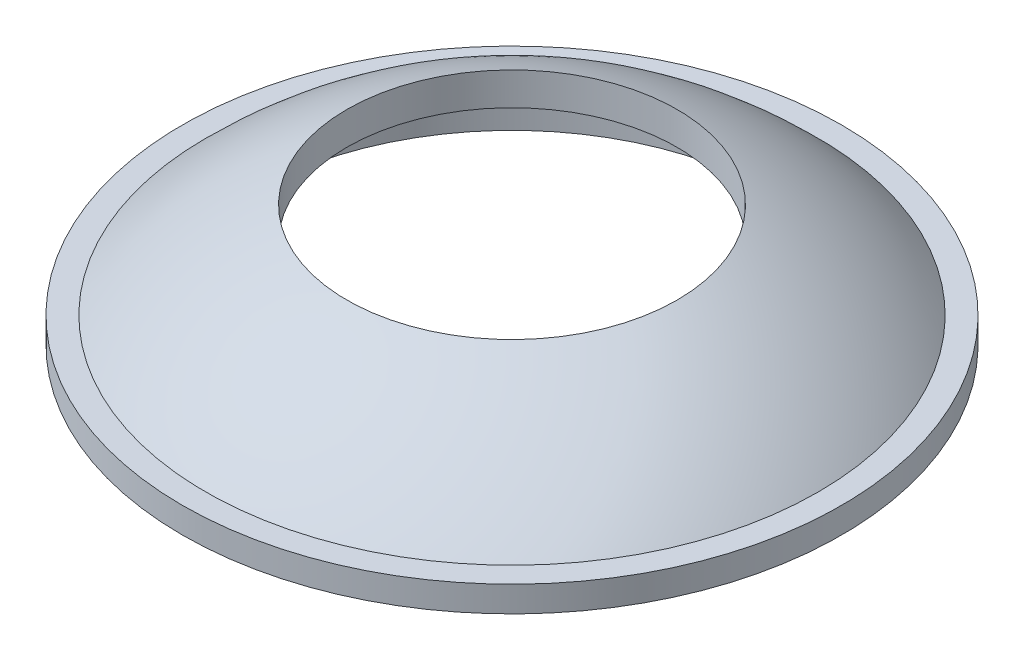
ISO-10303-21;
HEADER;
FILE_DESCRIPTION(('STEP AP214'),'2;1');
FILE_NAME('part.step','',(''),(''),'','','');
FILE_SCHEMA(('AUTOMOTIVE_DESIGN { 1 0 10303 214 1 1 1 1 }'));
ENDSEC;
DATA;
#1=APPLICATION_CONTEXT('core data for automotive mechanical design processes');
#2=APPLICATION_PROTOCOL_DEFINITION('international standard','automotive_design',2000,#1);
#3=PRODUCT_CONTEXT('',#1,'mechanical');
#4=PRODUCT('Part','Part','',(#3));
#5=PRODUCT_RELATED_PRODUCT_CATEGORY('part','',(#4));
#6=PRODUCT_DEFINITION_FORMATION('','',#4);
#7=PRODUCT_DEFINITION_CONTEXT('part definition',#1,'design');
#8=PRODUCT_DEFINITION('design','',#6,#7);
#9=PRODUCT_DEFINITION_SHAPE('','',#8);
#10=(LENGTH_UNIT() NAMED_UNIT(*) SI_UNIT(.MILLI.,.METRE.));
#11=(NAMED_UNIT(*) PLANE_ANGLE_UNIT() SI_UNIT($,.RADIAN.));
#12=(NAMED_UNIT(*) SI_UNIT($,.STERADIAN.) SOLID_ANGLE_UNIT());
#13=UNCERTAINTY_MEASURE_WITH_UNIT(LENGTH_MEASURE(1.E-05),#10,'distance_accuracy_value','');
#14=(GEOMETRIC_REPRESENTATION_CONTEXT(3) GLOBAL_UNCERTAINTY_ASSIGNED_CONTEXT((#13)) GLOBAL_UNIT_ASSIGNED_CONTEXT((#10,
#11,#12)) REPRESENTATION_CONTEXT('',''));
#15=CARTESIAN_POINT('',(0.,0.,0.));
#16=DIRECTION('',(0.,0.,1.));
#17=DIRECTION('',(1.,0.,0.));
#18=AXIS2_PLACEMENT_3D('',#15,#16,#17);
#19=CARTESIAN_POINT('',(0.,7.,0.));
#20=DIRECTION('',(0.,-1.,0.));
#21=DIRECTION('',(0.,0.,-1.));
#22=AXIS2_PLACEMENT_3D('',#19,#20,#21);
#23=CYLINDRICAL_SURFACE('',#22,6.125);
#24=CARTESIAN_POINT('',(0.,6.99816940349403,0.));
#25=DIRECTION('',(0.,-1.,0.));
#26=DIRECTION('',(0.,0.,-1.));
#27=AXIS2_PLACEMENT_3D('',#24,#25,#26);
#28=CIRCLE('',#27,6.125);
#29=CARTESIAN_POINT('',(6.125,6.99816940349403,0.));
#30=VERTEX_POINT('',#29);
#31=EDGE_CURVE('E43',#30,#30,#28,.T.);
#32=ORIENTED_EDGE('',*,*,#31,.F.);
#33=EDGE_LOOP('',(#32));
#34=FACE_BOUND('',#33,.T.);
#35=CARTESIAN_POINT('',(0.,6.4,0.));
#36=DIRECTION('',(0.,-1.,0.));
#37=DIRECTION('',(0.,0.,-1.));
#38=AXIS2_PLACEMENT_3D('',#35,#36,#37);
#39=CIRCLE('',#38,6.125);
#40=CARTESIAN_POINT('',(0.,6.4,-6.125));
#41=VERTEX_POINT('',#40);
#42=EDGE_CURVE('E57',#41,#41,#39,.T.);
#43=ORIENTED_EDGE('',*,*,#42,.T.);
#44=EDGE_LOOP('',(#43));
#45=FACE_BOUND('',#44,.T.);
#46=ADVANCED_FACE('F35',(#34,#45),#23,.F.);
#47=CARTESIAN_POINT('',(13.,6.4,-14.2353691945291));
#48=DIRECTION('',(0.,-1.,0.));
#49=DIRECTION('',(0.,0.,-1.));
#50=AXIS2_PLACEMENT_3D('',#47,#48,#49);
#51=PLANE('',#50);
#52=CARTESIAN_POINT('',(0.,6.4,0.));
#53=DIRECTION('',(0.,-1.,0.));
#54=DIRECTION('',(0.,0.,-1.));
#55=AXIS2_PLACEMENT_3D('',#52,#53,#54);
#56=CIRCLE('',#55,7.68374908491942);
#57=CARTESIAN_POINT('',(0.,6.4,-7.68374908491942));
#58=VERTEX_POINT('',#57);
#59=EDGE_CURVE('E10',#58,#58,#56,.F.);
#60=ORIENTED_EDGE('',*,*,#59,.F.);
#61=EDGE_LOOP('',(#60));
#62=FACE_BOUND('',#61,.T.);
#63=ORIENTED_EDGE('',*,*,#42,.F.);
#64=EDGE_LOOP('',(#63));
#65=FACE_BOUND('',#64,.T.);
#66=ADVANCED_FACE('F86',(#62,#65),#51,.T.);
#67=CARTESIAN_POINT('',(0.,0.,0.));
#68=DIRECTION('',(0.,-1.,0.));
#69=DIRECTION('',(1.,0.,0.));
#70=AXIS2_PLACEMENT_3D('',#67,#68,#69);
#71=SPHERICAL_SURFACE('',#70,9.3);
#72=CARTESIAN_POINT('',(0.,8.46566595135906,0.));
#73=DIRECTION('',(0.,-1.,0.));
#74=DIRECTION('',(0.,0.,-1.));
#75=AXIS2_PLACEMENT_3D('',#72,#73,#74);
#76=CIRCLE('',#75,3.85);
#77=CARTESIAN_POINT('',(3.85,8.46566595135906,0.));
#78=VERTEX_POINT('',#77);
#79=EDGE_CURVE('E61',#78,#78,#76,.T.);
#80=CARTESIAN_POINT('',(3.85,8.46566595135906,0.));
#81=CARTESIAN_POINT('',(3.87576201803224,8.45394995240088,0.));
#82=CARTESIAN_POINT('',(3.90147055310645,8.44211635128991,0.));
#83=CARTESIAN_POINT('',(3.95277852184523,8.4182149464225,0.));
#84=CARTESIAN_POINT('',(3.9783779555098,8.40614714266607,0.));
#85=CARTESIAN_POINT('',(4.02946558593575,8.38177833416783,0.));
#86=CARTESIAN_POINT('',(4.05495378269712,8.36947732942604,0.));
#87=CARTESIAN_POINT('',(4.10581681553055,8.34464314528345,0.));
#88=CARTESIAN_POINT('',(4.13119165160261,8.33210996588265,0.));
#89=CARTESIAN_POINT('',(4.18182584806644,8.30681247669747,0.));
#90=CARTESIAN_POINT('',(4.2070852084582,8.29404816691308,0.));
#91=CARTESIAN_POINT('',(4.25748634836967,8.26828948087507,0.));
#92=CARTESIAN_POINT('',(4.28262812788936,8.25529510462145,0.));
#93=CARTESIAN_POINT('',(4.33279201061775,8.22907736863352,0.));
#94=CARTESIAN_POINT('',(4.35781411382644,8.21585400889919,0.));
#95=CARTESIAN_POINT('',(4.4077365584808,8.18917940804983,0.));
#96=CARTESIAN_POINT('',(4.43263689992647,8.1757281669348,0.));
#97=CARTESIAN_POINT('',(4.48231374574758,8.14859892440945,0.));
#98=CARTESIAN_POINT('',(4.50709025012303,8.13492092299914,0.));
#99=CARTESIAN_POINT('',(4.55651735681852,8.10733929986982,0.));
#100=CARTESIAN_POINT('',(4.58116795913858,8.09343567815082,0.));
#101=CARTESIAN_POINT('',(4.63034120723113,8.06540397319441,0.));
#102=CARTESIAN_POINT('',(4.65486385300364,8.051275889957,0.));
#103=CARTESIAN_POINT('',(4.70377914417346,8.02279643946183,0.));
#104=CARTESIAN_POINT('',(4.72817178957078,8.00844507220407,0.));
#105=CARTESIAN_POINT('',(4.77682504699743,7.97952024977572,0.));
#106=CARTESIAN_POINT('',(4.80108565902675,7.96494679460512,0.));
#107=CARTESIAN_POINT('',(4.84947282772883,7.93557901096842,0.));
#108=CARTESIAN_POINT('',(4.87359938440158,7.92078468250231,0.));
#109=CARTESIAN_POINT('',(4.92171643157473,7.89097638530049,0.));
#110=CARTESIAN_POINT('',(4.94570692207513,7.87596241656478,0.));
#111=CARTESIAN_POINT('',(4.99354983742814,7.84571609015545,0.));
#112=CARTESIAN_POINT('',(5.01740226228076,7.83048373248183,0.));
#113=CARTESIAN_POINT('',(5.0649670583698,7.79980189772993,0.));
#114=CARTESIAN_POINT('',(5.08867942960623,7.78435242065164,0.));
#115=CARTESIAN_POINT('',(5.13596214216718,7.75323763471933,0.));
#116=CARTESIAN_POINT('',(5.15953248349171,7.7375723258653,0.));
#117=CARTESIAN_POINT('',(5.20652917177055,7.70602718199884,0.));
#118=CARTESIAN_POINT('',(5.22995551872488,7.69014734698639,0.));
#119=CARTESIAN_POINT('',(5.27666226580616,7.6581744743,0.));
#120=CARTESIAN_POINT('',(5.29994266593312,7.64208143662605,0.));
#121=CARTESIAN_POINT('',(5.34635557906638,7.6096834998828,0.));
#122=CARTESIAN_POINT('',(5.36948809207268,7.5933786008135,0.));
#123=CARTESIAN_POINT('',(5.41560330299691,7.56055830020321,0.));
#124=CARTESIAN_POINT('',(5.43858600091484,7.54404289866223,0.));
#125=CARTESIAN_POINT('',(5.48439966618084,7.51080296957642,0.));
#126=CARTESIAN_POINT('',(5.50723063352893,7.4940784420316,0.));
#127=CARTESIAN_POINT('',(5.55273893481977,7.46042165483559,0.));
#128=CARTESIAN_POINT('',(5.57541626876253,7.4434893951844,0.));
#129=CARTESIAN_POINT('',(5.62061541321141,7.40941855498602,0.));
#130=CARTESIAN_POINT('',(5.64313722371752,7.39227997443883,0.));
#131=CARTESIAN_POINT('',(5.68802344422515,7.35779792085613,0.));
#132=CARTESIAN_POINT('',(5.71038785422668,7.34045444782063,0.));
#133=CARTESIAN_POINT('',(5.7549574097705,7.30556405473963,0.));
#134=CARTESIAN_POINT('',(5.77716255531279,7.28801713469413,0.));
#135=CARTESIAN_POINT('',(5.82141173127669,7.25272131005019,0.));
#136=CARTESIAN_POINT('',(5.84345576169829,7.23497240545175,0.));
#137=CARTESIAN_POINT('',(5.88738087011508,7.19927409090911,0.));
#138=CARTESIAN_POINT('',(5.90926194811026,7.1813246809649,0.));
#139=CARTESIAN_POINT('',(5.95285932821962,7.14522685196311,0.));
#140=CARTESIAN_POINT('',(5.97457563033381,7.12707843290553,0.));
#141=CARTESIAN_POINT('',(6.01784164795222,7.09058409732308,0.));
#142=CARTESIAN_POINT('',(6.03939136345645,7.0722381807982,0.));
#143=CARTESIAN_POINT('',(6.08232241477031,7.03535038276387,0.));
#144=CARTESIAN_POINT('',(6.10370375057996,7.01680850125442,0.));
#145=CARTESIAN_POINT('',(6.125,6.99816940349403,0.));
#146=B_SPLINE_CURVE_WITH_KNOTS('',3,(#80,#81,#82,#83,#84,#85,#86,#87,#88,#89,#90,#91,#92,#93,
#94,#95,#96,#97,#98,#99,#100,#101,#102,#103,#104,#105,#106,#107,#108,#109,#110,#111,#112,#113,
#114,#115,#116,#117,#118,#119,#120,#121,#122,#123,#124,#125,#126,#127,#128,#129,#130,#131,#132,
#133,#134,#135,#136,#137,#138,#139,#140,#141,#142,#143,#144,#145),.UNSPECIFIED.,.F.,.F.,(4,2,2,
2,2,2,2,2,2,2,2,2,2,2,2,2,2,2,2,2,2,2,2,2,2,2,2,2,2,2,2,2,4),(0.,0.0849026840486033,
0.169805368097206,0.254708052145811,0.339610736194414,0.424513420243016,0.50941610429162,
0.594318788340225,0.679221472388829,0.76412415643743,0.849026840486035,0.933929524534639,
1.01883220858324,1.10373489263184,1.18863757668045,1.27354026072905,1.35844294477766,
1.44334562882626,1.52824831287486,1.61315099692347,1.69805368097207,1.78295636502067,
1.86785904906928,1.95276173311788,2.03766441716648,2.12256710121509,2.20746978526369,
2.29237246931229,2.3772751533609,2.4621778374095,2.5470805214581,2.63198320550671,
2.71688588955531),.UNSPECIFIED.);
#147=EDGE_CURVE('BSEAM93',#78,#30,#146,.T.);
#148=ORIENTED_EDGE('',*,*,#79,.F.);
#149=ORIENTED_EDGE('',*,*,#31,.T.);
#150=ORIENTED_EDGE('',*,*,#147,.T.);
#151=ORIENTED_EDGE('',*,*,#147,.F.);
#152=EDGE_LOOP('',(#148,#150,#149,#151));
#153=FACE_BOUND('',#152,.T.);
#154=ADVANCED_FACE('F93',(#153),#71,.F.);
#155=CARTESIAN_POINT('',(0.,7.,0.));
#156=DIRECTION('',(0.,-1.,0.));
#157=DIRECTION('',(0.,0.,-1.));
#158=AXIS2_PLACEMENT_3D('',#155,#156,#157);
#159=CYLINDRICAL_SURFACE('',#158,7.68374908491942);
#160=CARTESIAN_POINT('',(0.,7.,0.));
#161=DIRECTION('',(0.,-1.,0.));
#162=DIRECTION('',(0.,0.,-1.));
#163=AXIS2_PLACEMENT_3D('',#160,#161,#162);
#164=CIRCLE('',#163,7.68374908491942);
#165=CARTESIAN_POINT('',(0.,7.,-7.68374908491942));
#166=VERTEX_POINT('',#165);
#167=EDGE_CURVE('E51',#166,#166,#164,.T.);
#168=ORIENTED_EDGE('',*,*,#167,.T.);
#169=EDGE_LOOP('',(#168));
#170=FACE_BOUND('',#169,.T.);
#171=ORIENTED_EDGE('',*,*,#59,.T.);
#172=EDGE_LOOP('',(#171));
#173=FACE_BOUND('',#172,.T.);
#174=ADVANCED_FACE('F82',(#170,#173),#159,.T.);
#175=CARTESIAN_POINT('',(0.,7.,0.));
#176=DIRECTION('',(0.,-1.,0.));
#177=DIRECTION('',(0.,0.,-1.));
#178=AXIS2_PLACEMENT_3D('',#175,#176,#177);
#179=PLANE('',#178);
#180=CARTESIAN_POINT('',(0.,7.,0.));
#181=DIRECTION('',(0.,-1.,0.));
#182=DIRECTION('',(0.,0.,-1.));
#183=AXIS2_PLACEMENT_3D('',#180,#181,#182);
#184=CIRCLE('',#183,7.14142842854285);
#185=CARTESIAN_POINT('',(7.14142842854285,7.,0.));
#186=VERTEX_POINT('',#185);
#187=EDGE_CURVE('E48',#186,#186,#184,.F.);
#188=ORIENTED_EDGE('',*,*,#187,.F.);
#189=EDGE_LOOP('',(#188));
#190=FACE_BOUND('',#189,.T.);
#191=ORIENTED_EDGE('',*,*,#167,.F.);
#192=EDGE_LOOP('',(#191));
#193=FACE_BOUND('',#192,.T.);
#194=ADVANCED_FACE('F74',(#190,#193),#179,.F.);
#195=CARTESIAN_POINT('',(0.,0.,0.));
#196=DIRECTION('',(0.,-1.,0.));
#197=DIRECTION('',(1.,0.,0.));
#198=AXIS2_PLACEMENT_3D('',#195,#196,#197);
#199=SPHERICAL_SURFACE('',#198,10.);
#200=CARTESIAN_POINT('',(0.,9.22916572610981,0.));
#201=DIRECTION('',(0.,-1.,0.));
#202=DIRECTION('',(0.,0.,-1.));
#203=AXIS2_PLACEMENT_3D('',#200,#201,#202);
#204=CIRCLE('',#203,3.85);
#205=CARTESIAN_POINT('',(3.85,9.22916572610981,0.));
#206=VERTEX_POINT('',#205);
#207=EDGE_CURVE('E39',#206,#206,#204,.F.);
#208=CARTESIAN_POINT('',(3.85,9.22916572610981,0.));
#209=CARTESIAN_POINT('',(3.88847322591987,9.21311641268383,0.));
#210=CARTESIAN_POINT('',(3.92684608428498,9.19682650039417,0.));
#211=CARTESIAN_POINT('',(4.00338508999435,9.16376808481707,0.));
#212=CARTESIAN_POINT('',(4.04155123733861,9.14699958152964,0.));
#213=CARTESIAN_POINT('',(4.11767084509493,9.11298659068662,0.));
#214=CARTESIAN_POINT('',(4.15562430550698,9.09574210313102,0.));
#215=CARTESIAN_POINT('',(4.23131260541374,9.06077984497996,0.));
#216=CARTESIAN_POINT('',(4.26904744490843,9.04306207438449,0.));
#217=CARTESIAN_POINT('',(4.34429260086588,9.00715602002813,0.));
#218=CARTESIAN_POINT('',(4.38180291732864,8.98896773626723,0.));
#219=CARTESIAN_POINT('',(4.45659316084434,8.95212350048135,0.));
#220=CARTESIAN_POINT('',(4.4938730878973,8.93346754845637,0.));
#221=CARTESIAN_POINT('',(4.56819672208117,8.89569089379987,0.));
#222=CARTESIAN_POINT('',(4.60524042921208,8.87657019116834,0.));
#223=CARTESIAN_POINT('',(4.67908583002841,8.83786702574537,0.));
#224=CARTESIAN_POINT('',(4.71588752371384,8.81828456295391,0.));
#225=CARTESIAN_POINT('',(4.789243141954,8.77866093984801,0.));
#226=CARTESIAN_POINT('',(4.82579706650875,8.75861977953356,0.));
#227=CARTESIAN_POINT('',(4.89865142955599,8.71808189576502,0.));
#228=CARTESIAN_POINT('',(4.93495186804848,8.69758517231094,0.));
#229=CARTESIAN_POINT('',(5.00729358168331,8.65613936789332,0.));
#230=CARTESIAN_POINT('',(5.04333485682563,8.63519028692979,0.));
#231=CARTESIAN_POINT('',(5.11515260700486,8.59284304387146,0.));
#232=CARTESIAN_POINT('',(5.15092908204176,8.57144488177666,0.));
#233=CARTESIAN_POINT('',(5.22221163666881,8.52820282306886,0.));
#234=CARTESIAN_POINT('',(5.25771771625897,8.50635892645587,0.));
#235=CARTESIAN_POINT('',(5.32845392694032,8.46222881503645,0.));
#236=CARTESIAN_POINT('',(5.36368405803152,8.43994260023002,0.));
#237=CARTESIAN_POINT('',(5.43386286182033,8.3949313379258,0.));
#238=CARTESIAN_POINT('',(5.46881153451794,8.37220629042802,0.));
#239=CARTESIAN_POINT('',(5.53842195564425,8.32632091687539,0.));
#240=CARTESIAN_POINT('',(5.57308370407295,8.30316059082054,0.));
#241=CARTESIAN_POINT('',(5.64211485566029,8.25640828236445,0.));
#242=CARTESIAN_POINT('',(5.67648425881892,8.23281629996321,0.));
#243=CARTESIAN_POINT('',(5.74492534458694,8.18520436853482,0.));
#244=CARTESIAN_POINT('',(5.77899702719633,8.16118441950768,0.));
#245=CARTESIAN_POINT('',(5.84683734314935,8.1127203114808,0.));
#246=CARTESIAN_POINT('',(5.88060597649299,8.08827615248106,0.));
#247=CARTESIAN_POINT('',(5.94783491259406,8.03896744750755,0.));
#248=CARTESIAN_POINT('',(5.9812952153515,8.01410290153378,0.));
#249=CARTESIAN_POINT('',(6.04790225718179,7.96395731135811,0.));
#250=CARTESIAN_POINT('',(6.08104899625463,7.93867626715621,0.));
#251=CARTESIAN_POINT('',(6.14702372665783,7.8877016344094,0.));
#252=CARTESIAN_POINT('',(6.17985171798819,7.86200804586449,0.));
#253=CARTESIAN_POINT('',(6.24518381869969,7.81021234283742,0.));
#254=CARTESIAN_POINT('',(6.27768792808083,7.78411022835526,0.));
#255=CARTESIAN_POINT('',(6.34236718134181,7.73150155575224,0.));
#256=CARTESIAN_POINT('',(6.37454232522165,7.70499499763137,0.));
#257=CARTESIAN_POINT('',(6.4385586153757,7.65158158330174,0.));
#258=CARTESIAN_POINT('',(6.47039976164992,7.62467472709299,0.));
#259=CARTESIAN_POINT('',(6.53374307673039,7.5704649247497,0.));
#260=CARTESIAN_POINT('',(6.56524524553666,7.54316197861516,0.));
#261=CARTESIAN_POINT('',(6.62790567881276,7.48816426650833,0.));
#262=CARTESIAN_POINT('',(6.6590639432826,7.46046950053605,0.));
#263=CARTESIAN_POINT('',(6.7210316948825,7.40469248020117,0.));
#264=CARTESIAN_POINT('',(6.75184118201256,7.37661022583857,0.));
#265=CARTESIAN_POINT('',(6.8131065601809,7.32006262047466,0.));
#266=CARTESIAN_POINT('',(6.84356245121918,7.29159726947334,0.));
#267=CARTESIAN_POINT('',(6.90411587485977,7.23428792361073,0.));
#268=CARTESIAN_POINT('',(6.93421340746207,7.20544392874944,0.));
#269=CARTESIAN_POINT('',(6.99404540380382,7.14738180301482,0.));
#270=CARTESIAN_POINT('',(7.02377986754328,7.11816367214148,0.));
#271=CARTESIAN_POINT('',(7.08288108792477,7.05935785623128,0.));
#272=CARTESIAN_POINT('',(7.11224784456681,7.0297701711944,0.));
#273=CARTESIAN_POINT('',(7.14142842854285,7.,0.));
#274=B_SPLINE_CURVE_WITH_KNOTS('',3,(#208,#209,#210,#211,#212,#213,#214,#215,#216,#217,#218,
#219,#220,#221,#222,#223,#224,#225,#226,#227,#228,#229,#230,#231,#232,#233,#234,#235,#236,#237,
#238,#239,#240,#241,#242,#243,#244,#245,#246,#247,#248,#249,#250,#251,#252,#253,#254,#255,#256,
#257,#258,#259,#260,#261,#262,#263,#264,#265,#266,#267,#268,#269,#270,#271,#272,#273),
.UNSPECIFIED.,.F.,.F.,(4,2,2,2,2,2,2,2,2,2,2,2,2,2,2,2,2,2,2,2,2,2,2,2,2,2,2,2,2,2,2,2,4),(0.,
0.125058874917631,0.250117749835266,0.375176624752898,0.50023549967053,0.625294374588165,
0.750353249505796,0.875412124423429,1.00047099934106,1.12552987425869,1.25058874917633,
1.37564762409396,1.50070649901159,1.62576537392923,1.75082424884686,1.87588312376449,
2.00094199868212,2.12600087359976,2.25105974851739,2.37611862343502,2.50117749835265,
2.62623637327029,2.75129524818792,2.87635412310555,3.00141299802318,3.12647187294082,
3.25153074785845,3.37658962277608,3.50164849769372,3.62670737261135,3.75176624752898,
3.87682512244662,4.00188399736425),.UNSPECIFIED.);
#275=EDGE_CURVE('BSEAM37',#206,#186,#274,.T.);
#276=ORIENTED_EDGE('',*,*,#207,.F.);
#277=ORIENTED_EDGE('',*,*,#187,.T.);
#278=ORIENTED_EDGE('',*,*,#275,.T.);
#279=ORIENTED_EDGE('',*,*,#275,.F.);
#280=EDGE_LOOP('',(#276,#278,#277,#279));
#281=FACE_BOUND('',#280,.T.);
#282=ADVANCED_FACE('F37',(#281),#199,.T.);
#283=CARTESIAN_POINT('',(0.,13.7,0.));
#284=DIRECTION('',(0.,-1.,0.));
#285=DIRECTION('',(0.,0.,-1.));
#286=AXIS2_PLACEMENT_3D('',#283,#284,#285);
#287=CYLINDRICAL_SURFACE('',#286,3.85);
#288=ORIENTED_EDGE('',*,*,#79,.T.);
#289=EDGE_LOOP('',(#288));
#290=FACE_BOUND('',#289,.T.);
#291=ORIENTED_EDGE('',*,*,#207,.T.);
#292=EDGE_LOOP('',(#291));
#293=FACE_BOUND('',#292,.T.);
#294=ADVANCED_FACE('F71',(#290,#293),#287,.F.);
#295=CLOSED_SHELL('',(#46,#66,#154,#174,#194,#282,#294));
#296=MANIFOLD_SOLID_BREP('B2',#295);
#297=ADVANCED_BREP_SHAPE_REPRESENTATION('',(#18,#296),#14);
#298=SHAPE_DEFINITION_REPRESENTATION(#9,#297);
ENDSEC;
END-ISO-10303-21;
